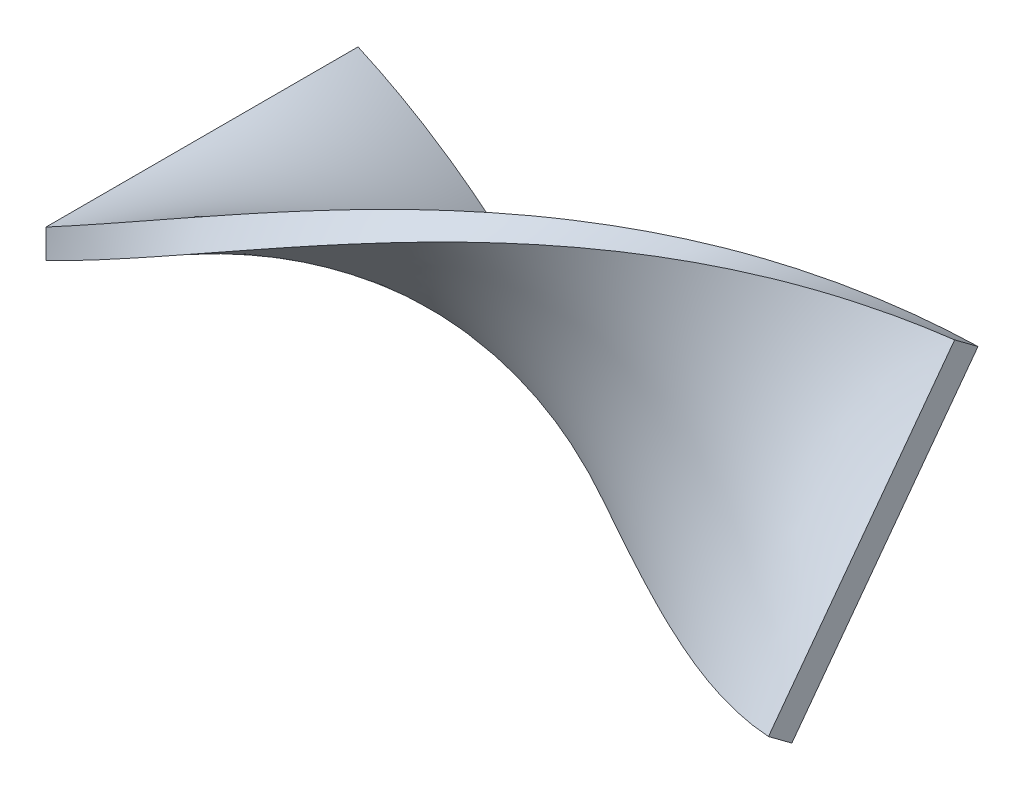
ISO-10303-21;
HEADER;
FILE_DESCRIPTION(('STEP AP214'),'2;1');
FILE_NAME('part.step','',(''),(''),'','','');
FILE_SCHEMA(('AUTOMOTIVE_DESIGN { 1 0 10303 214 1 1 1 1 }'));
ENDSEC;
DATA;
#1=APPLICATION_CONTEXT('core data for automotive mechanical design processes');
#2=APPLICATION_PROTOCOL_DEFINITION('international standard','automotive_design',2000,#1);
#3=PRODUCT_CONTEXT('',#1,'mechanical');
#4=PRODUCT('Part','Part','',(#3));
#5=PRODUCT_RELATED_PRODUCT_CATEGORY('part','',(#4));
#6=PRODUCT_DEFINITION_FORMATION('','',#4);
#7=PRODUCT_DEFINITION_CONTEXT('part definition',#1,'design');
#8=PRODUCT_DEFINITION('design','',#6,#7);
#9=PRODUCT_DEFINITION_SHAPE('','',#8);
#10=(LENGTH_UNIT() NAMED_UNIT(*) SI_UNIT(.MILLI.,.METRE.));
#11=(NAMED_UNIT(*) PLANE_ANGLE_UNIT() SI_UNIT($,.RADIAN.));
#12=(NAMED_UNIT(*) SI_UNIT($,.STERADIAN.) SOLID_ANGLE_UNIT());
#13=UNCERTAINTY_MEASURE_WITH_UNIT(LENGTH_MEASURE(1.E-05),#10,'distance_accuracy_value','');
#14=(GEOMETRIC_REPRESENTATION_CONTEXT(3) GLOBAL_UNCERTAINTY_ASSIGNED_CONTEXT((#13)) GLOBAL_UNIT_ASSIGNED_CONTEXT((#10,
#11,#12)) REPRESENTATION_CONTEXT('',''));
#15=CARTESIAN_POINT('',(0.,0.,0.));
#16=DIRECTION('',(0.,0.,1.));
#17=DIRECTION('',(1.,0.,0.));
#18=AXIS2_PLACEMENT_3D('',#15,#16,#17);
#19=CARTESIAN_POINT('',(-34.56399697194,0.,16.0727414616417));
#20=DIRECTION('',(1.,0.,0.));
#21=DIRECTION('',(0.,0.,-1.));
#22=AXIS2_PLACEMENT_3D('',#19,#20,#21);
#23=PLANE('',#22);
#24=DIRECTION('',(0.,0.,1.));
#25=VECTOR('',#24,1.);
#26=CARTESIAN_POINT('',(-34.5639969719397,0.,-9.19403442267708E-13));
#27=LINE('',#26,#25);
#28=CARTESIAN_POINT('',(-34.56399697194,0.,-16.0727414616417));
#29=VERTEX_POINT('',#28);
#30=CARTESIAN_POINT('',(-34.56399697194,0.,16.0727414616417));
#31=VERTEX_POINT('',#30);
#32=EDGE_CURVE('E13',#29,#31,#27,.T.);
#33=ORIENTED_EDGE('',*,*,#32,.T.);
#34=DIRECTION('',(0.,-1.,0.));
#35=VECTOR('',#34,1.);
#36=CARTESIAN_POINT('',(-34.5639969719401,1.5,16.0727414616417));
#37=LINE('',#36,#35);
#38=CARTESIAN_POINT('',(-34.56399697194,3.,16.0727414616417));
#39=VERTEX_POINT('',#38);
#40=EDGE_CURVE('E175',#39,#31,#37,.T.);
#41=ORIENTED_EDGE('',*,*,#40,.F.);
#42=DIRECTION('',(0.,0.,1.));
#43=VECTOR('',#42,1.);
#44=CARTESIAN_POINT('',(-34.5639969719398,2.99999999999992,-9.37618038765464E-13));
#45=LINE('',#44,#43);
#46=CARTESIAN_POINT('',(-34.56399697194,3.,-16.0727414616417));
#47=VERTEX_POINT('',#46);
#48=EDGE_CURVE('E219',#47,#39,#45,.T.);
#49=ORIENTED_EDGE('',*,*,#48,.F.);
#50=DIRECTION('',(0.,-1.,0.));
#51=VECTOR('',#50,1.);
#52=CARTESIAN_POINT('',(-34.5639969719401,1.5,-16.0727414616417));
#53=LINE('',#52,#51);
#54=EDGE_CURVE('E167',#47,#29,#53,.T.);
#55=ORIENTED_EDGE('',*,*,#54,.T.);
#56=EDGE_LOOP('',(#33,#41,#49,#55));
#57=FACE_BOUND('',#56,.T.);
#58=ADVANCED_FACE('F156',(#57),#23,.F.);
#59=CARTESIAN_POINT('',(34.56399697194,15.2574177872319,-8.40314606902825));
#60=CARTESIAN_POINT('',(34.5639969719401,14.6608497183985,-9.20570855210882));
#61=CARTESIAN_POINT('',(34.56399697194,14.0642816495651,-10.0082710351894));
#62=CARTESIAN_POINT('',(34.56399697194,13.4677135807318,-10.8108335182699));
#63=CARTESIAN_POINT('',(29.0780210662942,16.731185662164,-5.98622659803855));
#64=CARTESIAN_POINT('',(29.0780169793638,16.2753781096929,-6.89341544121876));
#65=CARTESIAN_POINT('',(29.0780170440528,15.819569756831,-7.80060634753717));
#66=CARTESIAN_POINT('',(29.0780212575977,15.3637596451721,-8.70779860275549));
#67=CARTESIAN_POINT('',(19.2023691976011,18.2032792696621,-0.923386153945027));
#68=CARTESIAN_POINT('',(19.2023692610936,18.0514827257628,-1.95010229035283));
#69=CARTESIAN_POINT('',(19.2023692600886,17.8996861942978,-2.97681839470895));
#70=CARTESIAN_POINT('',(19.2023691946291,17.7478896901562,-4.00353447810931));
#71=CARTESIAN_POINT('',(4.93771570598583,16.7892053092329,6.4655016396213));
#72=CARTESIAN_POINT('',(4.93771569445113,17.1012917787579,5.48413845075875));
#73=CARTESIAN_POINT('',(4.93771569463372,17.4133782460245,4.50277525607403));
#74=CARTESIAN_POINT('',(4.93771570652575,17.7254647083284,3.52141205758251));
#75=CARTESIAN_POINT('',(-7.1322556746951,13.1413503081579,11.6837538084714));
#76=CARTESIAN_POINT('',(-7.13225566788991,13.7960638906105,10.8978653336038));
#77=CARTESIAN_POINT('',(-7.13225566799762,14.4507774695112,10.1119768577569));
#78=CARTESIAN_POINT('',(-7.13225567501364,15.1054910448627,9.32608838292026));
#79=CARTESIAN_POINT('',(-20.29963871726,7.43456705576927,15.5247992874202));
#80=CARTESIAN_POINT('',(-20.2996387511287,8.35861208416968,15.0692213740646));
#81=CARTESIAN_POINT('',(-20.2996387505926,9.28265713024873,14.6136434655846));
#82=CARTESIAN_POINT('',(-20.2996387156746,10.2067021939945,14.1580655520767));
#83=CARTESIAN_POINT('',(-29.0780210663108,2.81893174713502,16.3318076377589));
#84=CARTESIAN_POINT('',(-29.0780169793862,3.81893578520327,16.1564217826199));
#85=CARTESIAN_POINT('',(-29.0780170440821,4.81893768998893,15.9810353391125));
#86=CARTESIAN_POINT('',(-29.0780212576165,5.81893746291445,15.8056495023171));
#87=CARTESIAN_POINT('',(-34.56399697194,0.,16.0727414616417));
#88=CARTESIAN_POINT('',(-34.5639969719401,1.,16.0727414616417));
#89=CARTESIAN_POINT('',(-34.56399697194,2.,16.0727414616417));
#90=CARTESIAN_POINT('',(-34.56399697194,3.,16.0727414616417));
#91=B_SPLINE_SURFACE_WITH_KNOTS('',3,3,((#59,#60,#61,#62),(#63,#64,#65,#66),(#67,#68,#69,#70),
(#71,#72,#73,#74),(#75,#76,#77,#78),(#79,#80,#81,#82),(#83,#84,#85,#86),(#87,#88,#89,#90)),
.UNSPECIFIED.,.F.,.F.,.F.,(4,1,1,1,1,4),(4,4),(0.,0.238098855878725,0.428572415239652,
0.619045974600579,0.761901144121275,1.),(0.,1.),.UNSPECIFIED.);
#92=CARTESIAN_POINT('',(-34.56399697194,0.,16.0727414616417));
#93=CARTESIAN_POINT('',(-29.0780210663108,2.81893174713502,16.3318076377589));
#94=CARTESIAN_POINT('',(-20.29963871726,7.43456705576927,15.5247992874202));
#95=CARTESIAN_POINT('',(-7.1322556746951,13.1413503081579,11.6837538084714));
#96=CARTESIAN_POINT('',(4.93771570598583,16.7892053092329,6.4655016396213));
#97=CARTESIAN_POINT('',(19.2023691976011,18.2032792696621,-0.923386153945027));
#98=CARTESIAN_POINT('',(29.0780210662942,16.731185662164,-5.98622659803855));
#99=CARTESIAN_POINT('',(34.56399697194,15.2574177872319,-8.40314606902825));
#100=B_SPLINE_CURVE_WITH_KNOTS('',3,(#92,#93,#94,#95,#96,#97,#98,#99),.UNSPECIFIED.,.F.,.F.,(4,
1,1,1,1,4),(0.,0.238098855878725,0.380954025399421,0.571427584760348,0.761901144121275,1.),.UNSPECIFIED.);
#101=CARTESIAN_POINT('',(34.56399697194,15.2574177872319,-8.40314606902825));
#102=VERTEX_POINT('',#101);
#103=EDGE_CURVE('E210',#31,#102,#100,.T.);
#104=DIRECTION('',(0.,0.596568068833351,0.802562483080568));
#105=VECTOR('',#104,1.);
#106=CARTESIAN_POINT('',(34.56399697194,14.3625656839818,-9.60698979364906));
#107=LINE('',#106,#105);
#108=CARTESIAN_POINT('',(34.56399697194,13.4677135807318,-10.8108335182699));
#109=VERTEX_POINT('',#108);
#110=EDGE_CURVE('E200',#109,#102,#107,.T.);
#111=CARTESIAN_POINT('',(-34.56399697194,3.,16.0727414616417));
#112=CARTESIAN_POINT('',(-30.1752330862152,5.25513667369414,15.8590188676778));
#113=CARTESIAN_POINT('',(-22.4941552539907,9.11927426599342,14.6391491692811));
#114=CARTESIAN_POINT('',(-11.5213318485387,13.6026591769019,11.0637547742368));
#115=CARTESIAN_POINT('',(0.548634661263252,17.0681462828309,5.79375677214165));
#116=CARTESIAN_POINT('',(11.5213219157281,18.008161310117,0.0114515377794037));
#117=CARTESIAN_POINT('',(23.5913997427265,16.7175966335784,-6.11855023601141));
#118=CARTESIAN_POINT('',(30.1752330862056,14.9845818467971,-9.12844550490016));
#119=CARTESIAN_POINT('',(34.56399697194,13.4677135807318,-10.8108335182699));
#120=B_SPLINE_CURVE_WITH_KNOTS('',3,(#111,#112,#113,#114,#115,#116,#117,#118,#119),
.UNSPECIFIED.,.F.,.F.,(4,1,1,1,1,1,4),(0.,0.190478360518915,0.333334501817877,0.47619064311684,
0.714284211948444,0.809521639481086,1.),.UNSPECIFIED.);
#121=EDGE_CURVE('E181',#39,#109,#120,.T.);
#122=ORIENTED_EDGE('',*,*,#103,.T.);
#123=ORIENTED_EDGE('',*,*,#110,.F.);
#124=ORIENTED_EDGE('',*,*,#121,.F.);
#125=ORIENTED_EDGE('',*,*,#40,.T.);
#126=EDGE_LOOP('',(#122,#123,#124,#125));
#127=FACE_BOUND('',#126,.T.);
#128=ADVANCED_FACE('F209',(#127),#91,.F.);
#129=CARTESIAN_POINT('',(34.56399697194,-10.541340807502,10.773822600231));
#130=DIRECTION('',(-1.,0.,0.));
#131=DIRECTION('',(0.,0.802562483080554,-0.59656806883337));
#132=AXIS2_PLACEMENT_3D('',#129,#130,#131);
#133=PLANE('',#132);
#134=DIRECTION('',(0.,-0.802562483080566,0.596568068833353));
#135=VECTOR('',#134,1.);
#136=CARTESIAN_POINT('',(34.5639969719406,2.35803848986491,1.1853382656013));
#137=LINE('',#136,#135);
#138=CARTESIAN_POINT('',(34.56399697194,-10.541340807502,10.773822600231));
#139=VERTEX_POINT('',#138);
#140=EDGE_CURVE('E212',#102,#139,#137,.T.);
#141=ORIENTED_EDGE('',*,*,#140,.T.);
#142=DIRECTION('',(0.,0.596568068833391,0.802562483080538));
#143=VECTOR('',#142,1.);
#144=CARTESIAN_POINT('',(34.56399697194,-11.4361929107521,9.56997887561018));
#145=LINE('',#144,#143);
#146=CARTESIAN_POINT('',(34.56399697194,-12.3310450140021,8.36613515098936));
#147=VERTEX_POINT('',#146);
#148=EDGE_CURVE('E205',#147,#139,#145,.T.);
#149=ORIENTED_EDGE('',*,*,#148,.F.);
#150=DIRECTION('',(0.,-0.80256248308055,0.596568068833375));
#151=VECTOR('',#150,1.);
#152=CARTESIAN_POINT('',(34.5639969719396,0.568334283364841,-1.2223491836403));
#153=LINE('',#152,#151);
#154=EDGE_CURVE('E204',#109,#147,#153,.T.);
#155=ORIENTED_EDGE('',*,*,#154,.F.);
#156=ORIENTED_EDGE('',*,*,#110,.T.);
#157=EDGE_LOOP('',(#141,#149,#155,#156));
#158=FACE_BOUND('',#157,.T.);
#159=ADVANCED_FACE('F158',(#158),#133,.F.);
#160=CARTESIAN_POINT('',(-34.56399697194,0.,-16.0727414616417));
#161=CARTESIAN_POINT('',(-34.56399697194,0.999999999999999,-16.0727414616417));
#162=CARTESIAN_POINT('',(-34.56399697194,2.,-16.0727414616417));
#163=CARTESIAN_POINT('',(-34.56399697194,3.,-16.0727414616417));
#164=CARTESIAN_POINT('',(-29.0780210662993,-2.81893174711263,-15.8136752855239));
#165=CARTESIAN_POINT('',(-29.078016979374,-1.8189357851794,-15.9890611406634));
#166=CARTESIAN_POINT('',(-29.0780170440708,-0.8189376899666,-16.164447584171));
#167=CARTESIAN_POINT('',(-29.0780212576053,0.181062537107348,-16.3398334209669));
#168=CARTESIAN_POINT('',(-19.202369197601,-7.76038158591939,-13.9747934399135));
#169=CARTESIAN_POINT('',(-19.2023692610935,-6.84582076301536,-14.4654732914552));
#170=CARTESIAN_POINT('',(-19.2023692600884,-5.93125997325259,-14.9561531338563));
#171=CARTESIAN_POINT('',(-19.202369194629,-5.01669921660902,-15.4468329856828));
#172=CARTESIAN_POINT('',(-4.93771570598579,-12.8468343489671,-8.43193620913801));
#173=CARTESIAN_POINT('',(-4.93771569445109,-12.2454098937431,-9.26785504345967));
#174=CARTESIAN_POINT('',(-4.93771569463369,-11.6439854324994,-10.1037738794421));
#175=CARTESIAN_POINT('',(-4.93771570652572,-11.0425609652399,-10.939692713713));
#176=CARTESIAN_POINT('',(7.13225567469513,-14.8586139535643,-2.39126202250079));
#177=CARTESIAN_POINT('',(7.13225566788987,-14.6184705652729,-3.38554655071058));
#178=CARTESIAN_POINT('',(7.13225566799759,-14.3783271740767,-4.37983107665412));
#179=CARTESIAN_POINT('',(7.13225567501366,-14.1381837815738,-5.37411559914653));
#180=CARTESIAN_POINT('',(20.2996387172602,-14.5368082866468,4.48023319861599));
#181=CARTESIAN_POINT('',(20.2996387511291,-14.7224343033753,3.46684609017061));
#182=CARTESIAN_POINT('',(20.299638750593,-14.9080603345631,2.45345897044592));
#183=CARTESIAN_POINT('',(20.2996387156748,-15.0936863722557,1.44007183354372));
#184=CARTESIAN_POINT('',(29.0780210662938,-12.4309422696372,8.66600434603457));
#185=CARTESIAN_POINT('',(29.0780169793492,-12.8867546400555,7.75880902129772));
#186=CARTESIAN_POINT('',(29.0780170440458,-13.3425652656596,6.8516150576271));
#187=CARTESIAN_POINT('',(29.0780212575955,-13.7983751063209,5.94442316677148));
#188=CARTESIAN_POINT('',(34.56399697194,-10.541340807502,10.773822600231));
#189=CARTESIAN_POINT('',(34.56399697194,-11.1379088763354,9.97126011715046));
#190=CARTESIAN_POINT('',(34.56399697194,-11.7344769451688,9.16869763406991));
#191=CARTESIAN_POINT('',(34.56399697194,-12.3310450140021,8.36613515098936));
#192=B_SPLINE_SURFACE_WITH_KNOTS('',3,3,((#160,#161,#162,#163),(#164,#165,#166,#167),(#168,#169,
#170,#171),(#172,#173,#174,#175),(#176,#177,#178,#179),(#180,#181,#182,#183),(#184,#185,#186,
#187),(#188,#189,#190,#191)),.UNSPECIFIED.,.F.,.F.,.F.,(4,1,1,1,1,4),(4,4),(0.,
0.238098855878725,0.428572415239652,0.61904597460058,0.761901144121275,1.),(0.,1.),.UNSPECIFIED.);
#193=CARTESIAN_POINT('',(34.56399697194,-10.541340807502,10.773822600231));
#194=CARTESIAN_POINT('',(29.0780210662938,-12.4309422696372,8.66600434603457));
#195=CARTESIAN_POINT('',(20.2996387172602,-14.5368082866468,4.48023319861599));
#196=CARTESIAN_POINT('',(7.13225567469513,-14.8586139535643,-2.39126202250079));
#197=CARTESIAN_POINT('',(-4.93771570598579,-12.8468343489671,-8.43193620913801));
#198=CARTESIAN_POINT('',(-19.202369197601,-7.76038158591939,-13.9747934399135));
#199=CARTESIAN_POINT('',(-29.0780210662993,-2.81893174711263,-15.8136752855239));
#200=CARTESIAN_POINT('',(-34.56399697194,0.,-16.0727414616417));
#201=B_SPLINE_CURVE_WITH_KNOTS('',3,(#193,#194,#195,#196,#197,#198,#199,#200),.UNSPECIFIED.,.F.,
.F.,(4,1,1,1,1,4),(0.,0.238098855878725,0.38095402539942,0.571427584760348,0.761901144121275,
1.),.UNSPECIFIED.);
#202=EDGE_CURVE('E213',#139,#29,#201,.T.);
#203=CARTESIAN_POINT('',(34.56399697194,-12.3310450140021,8.36613515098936));
#204=CARTESIAN_POINT('',(30.1752330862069,-13.5049046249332,6.42877292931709));
#205=CARTESIAN_POINT('',(23.5913997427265,-14.6417125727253,3.1469323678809));
#206=CARTESIAN_POINT('',(11.5213219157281,-14.757883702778,-3.11637212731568));
#207=CARTESIAN_POINT('',(0.548634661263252,-12.7484868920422,-8.6191901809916));
#208=CARTESIAN_POINT('',(-11.5213318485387,-8.35479809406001,-13.1444502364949));
#209=CARTESIAN_POINT('',(-22.4941552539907,-3.27963337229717,-15.8140735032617));
#210=CARTESIAN_POINT('',(-30.1752330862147,0.744858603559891,-16.2864142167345));
#211=CARTESIAN_POINT('',(-34.56399697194,3.,-16.0727414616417));
#212=B_SPLINE_CURVE_WITH_KNOTS('',3,(#203,#204,#205,#206,#207,#208,#209,#210,#211),
.UNSPECIFIED.,.F.,.F.,(4,1,1,1,1,1,4),(0.,0.190478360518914,0.285715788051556,0.523809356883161,
0.666665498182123,0.809521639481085,1.),.UNSPECIFIED.);
#213=EDGE_CURVE('E207',#147,#47,#212,.T.);
#214=ORIENTED_EDGE('',*,*,#202,.T.);
#215=ORIENTED_EDGE('',*,*,#54,.F.);
#216=ORIENTED_EDGE('',*,*,#213,.F.);
#217=ORIENTED_EDGE('',*,*,#148,.T.);
#218=EDGE_LOOP('',(#214,#215,#216,#217));
#219=FACE_BOUND('',#218,.T.);
#220=ADVANCED_FACE('F239',(#219),#192,.F.);
#221=CARTESIAN_POINT('',(-34.56399697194,3.,-16.0727414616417));
#222=CARTESIAN_POINT('',(-30.1752330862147,0.744858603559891,-16.2864142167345));
#223=CARTESIAN_POINT('',(-22.4941552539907,-3.27963337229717,-15.8140735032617));
#224=CARTESIAN_POINT('',(-11.5213318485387,-8.35479809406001,-13.1444502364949));
#225=CARTESIAN_POINT('',(0.548634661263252,-12.7484868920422,-8.6191901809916));
#226=CARTESIAN_POINT('',(11.5213219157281,-14.757883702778,-3.11637212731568));
#227=CARTESIAN_POINT('',(23.5913997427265,-14.6417125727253,3.1469323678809));
#228=CARTESIAN_POINT('',(30.1752330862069,-13.5049046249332,6.42877292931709));
#229=CARTESIAN_POINT('',(34.56399697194,-12.3310450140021,8.36613515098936));
#230=CARTESIAN_POINT('',(-34.5639969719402,3.,-5.35758048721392));
#231=CARTESIAN_POINT('',(-30.1748522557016,2.24808860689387,-5.57128839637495));
#232=CARTESIAN_POINT('',(-22.4941292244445,0.853322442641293,-5.66300054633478));
#233=CARTESIAN_POINT('',(-11.5213318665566,-1.03564566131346,-5.07504856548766));
#234=CARTESIAN_POINT('',(0.548634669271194,-2.80960917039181,-3.81487452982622));
#235=CARTESIAN_POINT('',(11.5213223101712,-3.83586859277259,-2.0737640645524));
#236=CARTESIAN_POINT('',(23.5913990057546,-4.18860970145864,0.058437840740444));
#237=CARTESIAN_POINT('',(30.1748522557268,-4.00851119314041,1.24286507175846));
#238=CARTESIAN_POINT('',(34.5639969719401,-3.73145881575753,1.97381226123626));
#239=CARTESIAN_POINT('',(-34.5639969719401,3.,5.35758048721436));
#240=CARTESIAN_POINT('',(-30.174852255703,3.75190666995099,5.1438559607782));
#241=CARTESIAN_POINT('',(-22.4941292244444,4.98631845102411,4.48807367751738));
#242=CARTESIAN_POINT('',(-11.5213318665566,6.2835067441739,2.9943531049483));
#243=CARTESIAN_POINT('',(0.548634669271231,7.12926856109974,0.989441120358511));
#244=CARTESIAN_POINT('',(11.521322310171,7.08614616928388,-1.03115650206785));
#245=CARTESIAN_POINT('',(23.5913990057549,6.26449381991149,-3.03005575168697));
#246=CARTESIAN_POINT('',(30.1748522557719,5.48821817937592,-3.9425597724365));
#247=CARTESIAN_POINT('',(34.56399697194,4.86812738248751,-4.41851062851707));
#248=CARTESIAN_POINT('',(-34.56399697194,3.,16.0727414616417));
#249=CARTESIAN_POINT('',(-30.1752330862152,5.25513667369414,15.8590188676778));
#250=CARTESIAN_POINT('',(-22.4941552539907,9.11927426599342,14.6391491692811));
#251=CARTESIAN_POINT('',(-11.5213318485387,13.6026591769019,11.0637547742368));
#252=CARTESIAN_POINT('',(0.548634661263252,17.0681462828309,5.79375677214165));
#253=CARTESIAN_POINT('',(11.5213219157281,18.008161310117,0.0114515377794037));
#254=CARTESIAN_POINT('',(23.5913997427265,16.7175966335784,-6.11855023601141));
#255=CARTESIAN_POINT('',(30.1752330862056,14.9845818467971,-9.12844550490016));
#256=CARTESIAN_POINT('',(34.56399697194,13.4677135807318,-10.8108335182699));
#257=B_SPLINE_SURFACE_WITH_KNOTS('',3,3,((#221,#222,#223,#224,#225,#226,#227,#228,#229),(#230,
#231,#232,#233,#234,#235,#236,#237,#238),(#239,#240,#241,#242,#243,#244,#245,#246,#247),(#248,
#249,#250,#251,#252,#253,#254,#255,#256)),.UNSPECIFIED.,.F.,.F.,.F.,(4,4),(4,1,1,1,1,1,4),(0.,
1.),(0.,0.190478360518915,0.333334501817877,0.47619064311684,0.714284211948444,
0.809521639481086,1.),.UNSPECIFIED.);
#258=ORIENTED_EDGE('',*,*,#48,.T.);
#259=ORIENTED_EDGE('',*,*,#121,.T.);
#260=ORIENTED_EDGE('',*,*,#154,.T.);
#261=ORIENTED_EDGE('',*,*,#213,.T.);
#262=EDGE_LOOP('',(#258,#259,#260,#261));
#263=FACE_BOUND('',#262,.T.);
#264=ADVANCED_FACE('F217',(#263),#257,.T.);
#265=CARTESIAN_POINT('',(-34.56399697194,0.,-16.0727414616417));
#266=CARTESIAN_POINT('',(-30.1752329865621,-2.25513679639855,-15.8654893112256));
#267=CARTESIAN_POINT('',(-22.4941551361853,-6.12170203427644,-14.6569366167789));
#268=CARTESIAN_POINT('',(-11.5213318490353,-10.6140460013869,-11.0952549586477));
#269=CARTESIAN_POINT('',(0.548634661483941,-14.0935853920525,-5.83653173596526));
#270=CARTESIAN_POINT('',(11.5213219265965,-15.0497900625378,-0.0584577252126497));
#271=CARTESIAN_POINT('',(23.5913996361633,-13.7770048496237,6.07356209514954));
#272=CARTESIAN_POINT('',(30.1752329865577,-12.0530162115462,9.0875744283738));
#273=CARTESIAN_POINT('',(34.56399697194,-10.541340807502,10.773822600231));
#274=CARTESIAN_POINT('',(-34.5639969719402,0.,-5.35758048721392));
#275=CARTESIAN_POINT('',(-30.1748520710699,-0.751906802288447,-5.15032696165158));
#276=CARTESIAN_POINT('',(-22.4941291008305,-1.9887461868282,-4.50586118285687));
#277=CARTESIAN_POINT('',(-11.5213318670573,-3.29489356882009,-3.02585328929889));
#278=CARTESIAN_POINT('',(0.548634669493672,-4.15470767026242,-1.03221608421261));
#279=CARTESIAN_POINT('',(11.5213223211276,-4.12777492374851,0.984150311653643));
#280=CARTESIAN_POINT('',(23.591398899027,-3.32390202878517,2.98506764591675));
#281=CARTESIAN_POINT('',(30.1748520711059,-2.55665210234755,3.90168835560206));
#282=CARTESIAN_POINT('',(34.5639969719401,-1.9417546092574,4.38149971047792));
#283=CARTESIAN_POINT('',(-34.5639969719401,0.,5.35758048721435));
#284=CARTESIAN_POINT('',(-30.1748520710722,0.751911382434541,5.56481739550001));
#285=CARTESIAN_POINT('',(-22.4941291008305,2.14424986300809,5.64521302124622));
#286=CARTESIAN_POINT('',(-11.5213318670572,4.02425883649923,5.04354838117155));
#287=CARTESIAN_POINT('',(0.548634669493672,5.78417006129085,3.77209956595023));
#288=CARTESIAN_POINT('',(11.5213223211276,6.79423983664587,2.02675787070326));
#289=CARTESIAN_POINT('',(23.5913988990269,7.12920149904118,-0.103425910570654));
#290=CARTESIAN_POINT('',(30.1748520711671,6.94007734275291,-1.28373639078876));
#291=CARTESIAN_POINT('',(34.5639969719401,6.6578315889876,-2.01082317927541));
#292=CARTESIAN_POINT('',(-34.56399697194,0.,16.0727414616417));
#293=CARTESIAN_POINT('',(-30.1752329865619,2.25514137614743,16.2799437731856));
#294=CARTESIAN_POINT('',(-22.4941551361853,6.27720571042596,15.796285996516));
#295=CARTESIAN_POINT('',(-11.5213318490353,11.343411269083,13.1129500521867));
#296=CARTESIAN_POINT('',(0.548634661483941,15.7230477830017,8.57641521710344));
#297=CARTESIAN_POINT('',(11.5213219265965,17.7162549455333,3.06936592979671));
#298=CARTESIAN_POINT('',(23.5913996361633,17.582304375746,-3.19192040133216));
#299=CARTESIAN_POINT('',(30.1752329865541,16.436470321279,-6.46964392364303));
#300=CARTESIAN_POINT('',(34.56399697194,15.2574177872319,-8.40314606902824));
#301=B_SPLINE_SURFACE_WITH_KNOTS('',3,3,((#265,#266,#267,#268,#269,#270,#271,#272,#273),(#274,
#275,#276,#277,#278,#279,#280,#281,#282),(#283,#284,#285,#286,#287,#288,#289,#290,#291),(#292,
#293,#294,#295,#296,#297,#298,#299,#300)),.UNSPECIFIED.,.F.,.F.,.F.,(4,4),(4,1,1,1,1,1,4),(0.,
1.),(0.,0.190478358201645,0.333334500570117,0.476190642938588,0.714284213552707,
0.809521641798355,1.),.UNSPECIFIED.);
#302=ORIENTED_EDGE('',*,*,#32,.F.);
#303=ORIENTED_EDGE('',*,*,#202,.F.);
#304=ORIENTED_EDGE('',*,*,#140,.F.);
#305=ORIENTED_EDGE('',*,*,#103,.F.);
#306=EDGE_LOOP('',(#302,#303,#304,#305));
#307=FACE_BOUND('',#306,.T.);
#308=ADVANCED_FACE('F238',(#307),#301,.F.);
#309=CLOSED_SHELL('',(#58,#128,#159,#220,#264,#308));
#310=MANIFOLD_SOLID_BREP('B2',#309);
#311=ADVANCED_BREP_SHAPE_REPRESENTATION('',(#18,#310),#14);
#312=SHAPE_DEFINITION_REPRESENTATION(#9,#311);
ENDSEC;
END-ISO-10303-21;
